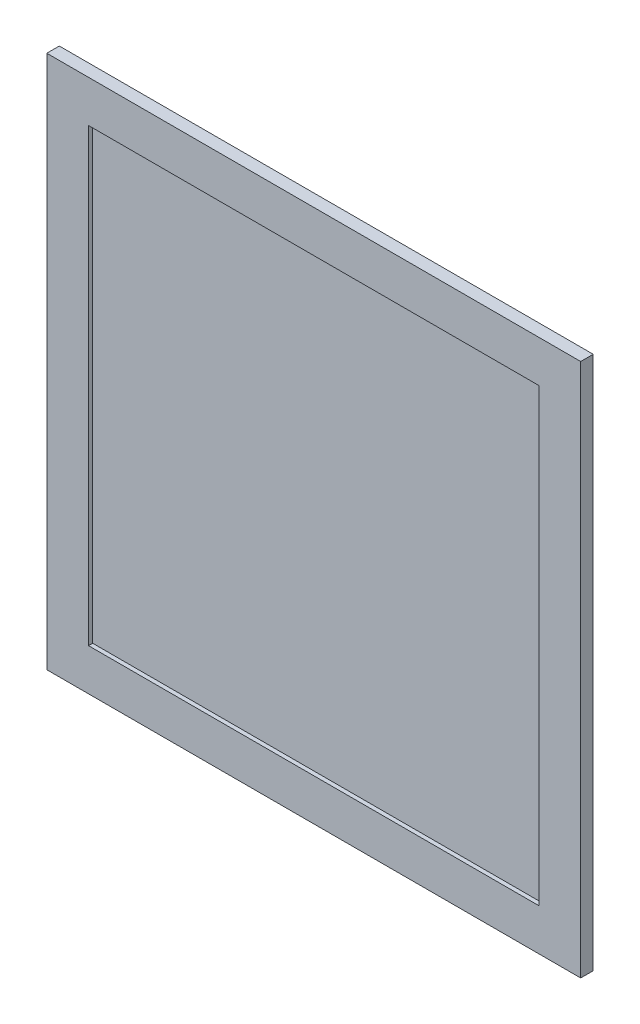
ISO-10303-21;
HEADER;
FILE_DESCRIPTION(('STEP AP214'),'2;1');
FILE_NAME('part.step','',(''),(''),'','','');
FILE_SCHEMA(('AUTOMOTIVE_DESIGN { 1 0 10303 214 1 1 1 1 }'));
ENDSEC;
DATA;
#1=APPLICATION_CONTEXT('core data for automotive mechanical design processes');
#2=APPLICATION_PROTOCOL_DEFINITION('international standard','automotive_design',2000,#1);
#3=PRODUCT_CONTEXT('',#1,'mechanical');
#4=PRODUCT('Part','Part','',(#3));
#5=PRODUCT_RELATED_PRODUCT_CATEGORY('part','',(#4));
#6=PRODUCT_DEFINITION_FORMATION('','',#4);
#7=PRODUCT_DEFINITION_CONTEXT('part definition',#1,'design');
#8=PRODUCT_DEFINITION('design','',#6,#7);
#9=PRODUCT_DEFINITION_SHAPE('','',#8);
#10=(LENGTH_UNIT() NAMED_UNIT(*) SI_UNIT(.MILLI.,.METRE.));
#11=(NAMED_UNIT(*) PLANE_ANGLE_UNIT() SI_UNIT($,.RADIAN.));
#12=(NAMED_UNIT(*) SI_UNIT($,.STERADIAN.) SOLID_ANGLE_UNIT());
#13=UNCERTAINTY_MEASURE_WITH_UNIT(LENGTH_MEASURE(1.E-05),#10,'distance_accuracy_value','');
#14=(GEOMETRIC_REPRESENTATION_CONTEXT(3) GLOBAL_UNCERTAINTY_ASSIGNED_CONTEXT((#13)) GLOBAL_UNIT_ASSIGNED_CONTEXT((#10,
#11,#12)) REPRESENTATION_CONTEXT('',''));
#15=CARTESIAN_POINT('',(0.,0.,0.));
#16=DIRECTION('',(0.,0.,1.));
#17=DIRECTION('',(1.,0.,0.));
#18=AXIS2_PLACEMENT_3D('',#15,#16,#17);
#19=CARTESIAN_POINT('',(0.,0.,0.5));
#20=DIRECTION('',(0.,0.,1.));
#21=DIRECTION('',(1.,0.,0.));
#22=AXIS2_PLACEMENT_3D('',#19,#20,#21);
#23=PLANE('',#22);
#24=DIRECTION('',(1.,0.,0.));
#25=VECTOR('',#24,1.);
#26=CARTESIAN_POINT('',(0.,54.,0.5));
#27=LINE('',#26,#25);
#28=CARTESIAN_POINT('',(-54.,54.,0.5));
#29=VERTEX_POINT('',#28);
#30=CARTESIAN_POINT('',(54.,54.,0.5));
#31=VERTEX_POINT('',#30);
#32=EDGE_CURVE('E50',#29,#31,#27,.T.);
#33=ORIENTED_EDGE('',*,*,#32,.F.);
#34=DIRECTION('',(0.,1.,0.));
#35=VECTOR('',#34,1.);
#36=CARTESIAN_POINT('',(-54.,0.,0.5));
#37=LINE('',#36,#35);
#38=CARTESIAN_POINT('',(-54.,-54.,0.5));
#39=VERTEX_POINT('',#38);
#40=EDGE_CURVE('E54',#39,#29,#37,.T.);
#41=ORIENTED_EDGE('',*,*,#40,.F.);
#42=DIRECTION('',(-1.,0.,0.));
#43=VECTOR('',#42,1.);
#44=CARTESIAN_POINT('',(0.,-54.,0.5));
#45=LINE('',#44,#43);
#46=CARTESIAN_POINT('',(54.,-54.,0.5));
#47=VERTEX_POINT('',#46);
#48=EDGE_CURVE('E197',#47,#39,#45,.T.);
#49=ORIENTED_EDGE('',*,*,#48,.F.);
#50=DIRECTION('',(0.,-1.,0.));
#51=VECTOR('',#50,1.);
#52=CARTESIAN_POINT('',(54.,0.,0.5));
#53=LINE('',#52,#51);
#54=EDGE_CURVE('E184',#31,#47,#53,.T.);
#55=ORIENTED_EDGE('',*,*,#54,.F.);
#56=EDGE_LOOP('',(#33,#41,#49,#55));
#57=FACE_BOUND('',#56,.T.);
#58=ADVANCED_FACE('F35',(#57),#23,.T.);
#59=CARTESIAN_POINT('',(0.,0.,1.5));
#60=DIRECTION('',(0.,0.,1.));
#61=DIRECTION('',(1.,0.,0.));
#62=AXIS2_PLACEMENT_3D('',#59,#60,#61);
#63=PLANE('',#62);
#64=DIRECTION('',(-1.,0.,0.));
#65=VECTOR('',#64,1.);
#66=CARTESIAN_POINT('',(64.,64.,1.5));
#67=LINE('',#66,#65);
#68=CARTESIAN_POINT('',(64.,64.,1.5));
#69=VERTEX_POINT('',#68);
#70=CARTESIAN_POINT('',(-64.,64.,1.5));
#71=VERTEX_POINT('',#70);
#72=EDGE_CURVE('E171',#69,#71,#67,.T.);
#73=ORIENTED_EDGE('',*,*,#72,.T.);
#74=DIRECTION('',(0.,-1.,0.));
#75=VECTOR('',#74,1.);
#76=CARTESIAN_POINT('',(-64.,64.,1.5));
#77=LINE('',#76,#75);
#78=CARTESIAN_POINT('',(-64.,-64.,1.5));
#79=VERTEX_POINT('',#78);
#80=EDGE_CURVE('E174',#71,#79,#77,.T.);
#81=ORIENTED_EDGE('',*,*,#80,.T.);
#82=DIRECTION('',(1.,0.,0.));
#83=VECTOR('',#82,1.);
#84=CARTESIAN_POINT('',(-64.,-64.,1.5));
#85=LINE('',#84,#83);
#86=CARTESIAN_POINT('',(64.,-64.,1.5));
#87=VERTEX_POINT('',#86);
#88=EDGE_CURVE('E178',#79,#87,#85,.T.);
#89=ORIENTED_EDGE('',*,*,#88,.T.);
#90=DIRECTION('',(0.,1.,0.));
#91=VECTOR('',#90,1.);
#92=CARTESIAN_POINT('',(64.,-64.,1.5));
#93=LINE('',#92,#91);
#94=EDGE_CURVE('E181',#87,#69,#93,.T.);
#95=ORIENTED_EDGE('',*,*,#94,.T.);
#96=EDGE_LOOP('',(#73,#81,#89,#95));
#97=FACE_BOUND('',#96,.T.);
#98=DIRECTION('',(0.,-1.,0.));
#99=VECTOR('',#98,1.);
#100=CARTESIAN_POINT('',(-54.,54.,1.5));
#101=LINE('',#100,#99);
#102=CARTESIAN_POINT('',(-54.,54.,1.5));
#103=VERTEX_POINT('',#102);
#104=CARTESIAN_POINT('',(-54.,-54.,1.5));
#105=VERTEX_POINT('',#104);
#106=EDGE_CURVE('E132',#103,#105,#101,.T.);
#107=ORIENTED_EDGE('',*,*,#106,.F.);
#108=DIRECTION('',(-1.,0.,0.));
#109=VECTOR('',#108,1.);
#110=CARTESIAN_POINT('',(54.,54.,1.5));
#111=LINE('',#110,#109);
#112=CARTESIAN_POINT('',(54.,54.,1.5));
#113=VERTEX_POINT('',#112);
#114=EDGE_CURVE('E123',#113,#103,#111,.T.);
#115=ORIENTED_EDGE('',*,*,#114,.F.);
#116=DIRECTION('',(0.,1.,0.));
#117=VECTOR('',#116,1.);
#118=CARTESIAN_POINT('',(54.,-54.,1.5));
#119=LINE('',#118,#117);
#120=CARTESIAN_POINT('',(54.,-54.,1.5));
#121=VERTEX_POINT('',#120);
#122=EDGE_CURVE('E147',#121,#113,#119,.T.);
#123=ORIENTED_EDGE('',*,*,#122,.F.);
#124=DIRECTION('',(1.,0.,0.));
#125=VECTOR('',#124,1.);
#126=CARTESIAN_POINT('',(-54.,-54.,1.5));
#127=LINE('',#126,#125);
#128=EDGE_CURVE('E145',#105,#121,#127,.T.);
#129=ORIENTED_EDGE('',*,*,#128,.F.);
#130=EDGE_LOOP('',(#107,#115,#123,#129));
#131=FACE_BOUND('',#130,.T.);
#132=ADVANCED_FACE('F143',(#97,#131),#63,.T.);
#133=CARTESIAN_POINT('',(54.,54.,1.5));
#134=DIRECTION('',(0.,-1.,0.));
#135=DIRECTION('',(0.,0.,-1.));
#136=AXIS2_PLACEMENT_3D('',#133,#134,#135);
#137=PLANE('',#136);
#138=DIRECTION('',(0.,0.,-1.));
#139=VECTOR('',#138,1.);
#140=CARTESIAN_POINT('',(-54.,54.,1.5));
#141=LINE('',#140,#139);
#142=EDGE_CURVE('E126',#103,#29,#141,.T.);
#143=ORIENTED_EDGE('',*,*,#142,.T.);
#144=ORIENTED_EDGE('',*,*,#32,.T.);
#145=DIRECTION('',(0.,0.,-1.));
#146=VECTOR('',#145,1.);
#147=CARTESIAN_POINT('',(54.,54.,1.5));
#148=LINE('',#147,#146);
#149=EDGE_CURVE('E128',#113,#31,#148,.T.);
#150=ORIENTED_EDGE('',*,*,#149,.F.);
#151=ORIENTED_EDGE('',*,*,#114,.T.);
#152=EDGE_LOOP('',(#143,#144,#150,#151));
#153=FACE_BOUND('',#152,.T.);
#154=ADVANCED_FACE('F125',(#153),#137,.T.);
#155=CARTESIAN_POINT('',(-54.,54.,1.5));
#156=DIRECTION('',(1.,0.,0.));
#157=DIRECTION('',(0.,0.,-1.));
#158=AXIS2_PLACEMENT_3D('',#155,#156,#157);
#159=PLANE('',#158);
#160=DIRECTION('',(0.,0.,-1.));
#161=VECTOR('',#160,1.);
#162=CARTESIAN_POINT('',(-54.,-54.,1.5));
#163=LINE('',#162,#161);
#164=EDGE_CURVE('E169',#105,#39,#163,.T.);
#165=ORIENTED_EDGE('',*,*,#164,.T.);
#166=ORIENTED_EDGE('',*,*,#40,.T.);
#167=ORIENTED_EDGE('',*,*,#142,.F.);
#168=ORIENTED_EDGE('',*,*,#106,.T.);
#169=EDGE_LOOP('',(#165,#166,#167,#168));
#170=FACE_BOUND('',#169,.T.);
#171=ADVANCED_FACE('F137',(#170),#159,.T.);
#172=CARTESIAN_POINT('',(-54.,-54.,1.5));
#173=DIRECTION('',(0.,1.,0.));
#174=DIRECTION('',(-1.,0.,0.));
#175=AXIS2_PLACEMENT_3D('',#172,#173,#174);
#176=PLANE('',#175);
#177=DIRECTION('',(0.,0.,-1.));
#178=VECTOR('',#177,1.);
#179=CARTESIAN_POINT('',(54.,-54.,1.5));
#180=LINE('',#179,#178);
#181=EDGE_CURVE('E165',#121,#47,#180,.T.);
#182=ORIENTED_EDGE('',*,*,#181,.T.);
#183=ORIENTED_EDGE('',*,*,#48,.T.);
#184=ORIENTED_EDGE('',*,*,#164,.F.);
#185=ORIENTED_EDGE('',*,*,#128,.T.);
#186=EDGE_LOOP('',(#182,#183,#184,#185));
#187=FACE_BOUND('',#186,.T.);
#188=ADVANCED_FACE('F243',(#187),#176,.T.);
#189=CARTESIAN_POINT('',(54.,-54.,1.5));
#190=DIRECTION('',(-1.,0.,0.));
#191=DIRECTION('',(0.,0.,1.));
#192=AXIS2_PLACEMENT_3D('',#189,#190,#191);
#193=PLANE('',#192);
#194=ORIENTED_EDGE('',*,*,#149,.T.);
#195=ORIENTED_EDGE('',*,*,#54,.T.);
#196=ORIENTED_EDGE('',*,*,#181,.F.);
#197=ORIENTED_EDGE('',*,*,#122,.T.);
#198=EDGE_LOOP('',(#194,#195,#196,#197));
#199=FACE_BOUND('',#198,.T.);
#200=ADVANCED_FACE('F237',(#199),#193,.T.);
#201=CARTESIAN_POINT('',(64.,-64.,0.5));
#202=DIRECTION('',(-1.,0.,0.));
#203=DIRECTION('',(0.,0.,1.));
#204=AXIS2_PLACEMENT_3D('',#201,#202,#203);
#205=PLANE('',#204);
#206=DIRECTION('',(0.,0.,-1.));
#207=VECTOR('',#206,1.);
#208=CARTESIAN_POINT('',(64.,-64.,0.5));
#209=LINE('',#208,#207);
#210=CARTESIAN_POINT('',(64.,-64.,-1.5));
#211=VERTEX_POINT('',#210);
#212=EDGE_CURVE('E205',#87,#211,#209,.T.);
#213=ORIENTED_EDGE('',*,*,#212,.T.);
#214=DIRECTION('',(0.,1.,0.));
#215=VECTOR('',#214,1.);
#216=CARTESIAN_POINT('',(64.,-64.,-1.5));
#217=LINE('',#216,#215);
#218=CARTESIAN_POINT('',(64.,64.,-1.5));
#219=VERTEX_POINT('',#218);
#220=EDGE_CURVE('E175',#211,#219,#217,.T.);
#221=ORIENTED_EDGE('',*,*,#220,.T.);
#222=DIRECTION('',(0.,0.,-1.));
#223=VECTOR('',#222,1.);
#224=CARTESIAN_POINT('',(64.,64.,0.5));
#225=LINE('',#224,#223);
#226=EDGE_CURVE('E203',#69,#219,#225,.T.);
#227=ORIENTED_EDGE('',*,*,#226,.F.);
#228=ORIENTED_EDGE('',*,*,#94,.F.);
#229=EDGE_LOOP('',(#213,#221,#227,#228));
#230=FACE_BOUND('',#229,.T.);
#231=ADVANCED_FACE('F248',(#230),#205,.F.);
#232=CARTESIAN_POINT('',(64.,-64.,0.5));
#233=DIRECTION('',(0.,1.,0.));
#234=DIRECTION('',(-1.,0.,0.));
#235=AXIS2_PLACEMENT_3D('',#232,#233,#234);
#236=PLANE('',#235);
#237=DIRECTION('',(0.,0.,-1.));
#238=VECTOR('',#237,1.);
#239=CARTESIAN_POINT('',(-64.,-64.,0.5));
#240=LINE('',#239,#238);
#241=CARTESIAN_POINT('',(-64.,-64.,-1.5));
#242=VERTEX_POINT('',#241);
#243=EDGE_CURVE('E207',#79,#242,#240,.T.);
#244=ORIENTED_EDGE('',*,*,#243,.T.);
#245=DIRECTION('',(1.,0.,0.));
#246=VECTOR('',#245,1.);
#247=CARTESIAN_POINT('',(-64.,-64.,-1.5));
#248=LINE('',#247,#246);
#249=EDGE_CURVE('E190',#242,#211,#248,.T.);
#250=ORIENTED_EDGE('',*,*,#249,.T.);
#251=ORIENTED_EDGE('',*,*,#212,.F.);
#252=ORIENTED_EDGE('',*,*,#88,.F.);
#253=EDGE_LOOP('',(#244,#250,#251,#252));
#254=FACE_BOUND('',#253,.T.);
#255=ADVANCED_FACE('F264',(#254),#236,.F.);
#256=CARTESIAN_POINT('',(-64.,-64.,0.5));
#257=DIRECTION('',(1.,0.,0.));
#258=DIRECTION('',(0.,0.,-1.));
#259=AXIS2_PLACEMENT_3D('',#256,#257,#258);
#260=PLANE('',#259);
#261=DIRECTION('',(0.,0.,-1.));
#262=VECTOR('',#261,1.);
#263=CARTESIAN_POINT('',(-64.,64.,0.5));
#264=LINE('',#263,#262);
#265=CARTESIAN_POINT('',(-64.,64.,-1.5));
#266=VERTEX_POINT('',#265);
#267=EDGE_CURVE('E201',#71,#266,#264,.T.);
#268=ORIENTED_EDGE('',*,*,#267,.T.);
#269=DIRECTION('',(0.,-1.,0.));
#270=VECTOR('',#269,1.);
#271=CARTESIAN_POINT('',(-64.,64.,-1.5));
#272=LINE('',#271,#270);
#273=EDGE_CURVE('E187',#266,#242,#272,.T.);
#274=ORIENTED_EDGE('',*,*,#273,.T.);
#275=ORIENTED_EDGE('',*,*,#243,.F.);
#276=ORIENTED_EDGE('',*,*,#80,.F.);
#277=EDGE_LOOP('',(#268,#274,#275,#276));
#278=FACE_BOUND('',#277,.T.);
#279=ADVANCED_FACE('F37',(#278),#260,.F.);
#280=CARTESIAN_POINT('',(64.,64.,0.5));
#281=DIRECTION('',(0.,-1.,0.));
#282=DIRECTION('',(0.,0.,-1.));
#283=AXIS2_PLACEMENT_3D('',#280,#281,#282);
#284=PLANE('',#283);
#285=ORIENTED_EDGE('',*,*,#226,.T.);
#286=DIRECTION('',(-1.,0.,0.));
#287=VECTOR('',#286,1.);
#288=CARTESIAN_POINT('',(64.,64.,-1.5));
#289=LINE('',#288,#287);
#290=EDGE_CURVE('E139',#219,#266,#289,.T.);
#291=ORIENTED_EDGE('',*,*,#290,.T.);
#292=ORIENTED_EDGE('',*,*,#267,.F.);
#293=ORIENTED_EDGE('',*,*,#72,.F.);
#294=EDGE_LOOP('',(#285,#291,#292,#293));
#295=FACE_BOUND('',#294,.T.);
#296=ADVANCED_FACE('F244',(#295),#284,.F.);
#297=CARTESIAN_POINT('',(0.,0.,-1.5));
#298=DIRECTION('',(0.,0.,1.));
#299=DIRECTION('',(1.,0.,0.));
#300=AXIS2_PLACEMENT_3D('',#297,#298,#299);
#301=PLANE('',#300);
#302=ORIENTED_EDGE('',*,*,#290,.F.);
#303=ORIENTED_EDGE('',*,*,#220,.F.);
#304=ORIENTED_EDGE('',*,*,#249,.F.);
#305=ORIENTED_EDGE('',*,*,#273,.F.);
#306=EDGE_LOOP('',(#302,#303,#304,#305));
#307=FACE_BOUND('',#306,.T.);
#308=DIRECTION('',(-1.,0.,0.));
#309=VECTOR('',#308,1.);
#310=CARTESIAN_POINT('',(54.,54.,-1.5));
#311=LINE('',#310,#309);
#312=CARTESIAN_POINT('',(54.,54.,-1.5));
#313=VERTEX_POINT('',#312);
#314=CARTESIAN_POINT('',(-54.,54.,-1.5));
#315=VERTEX_POINT('',#314);
#316=EDGE_CURVE('E152',#313,#315,#311,.T.);
#317=ORIENTED_EDGE('',*,*,#316,.T.);
#318=DIRECTION('',(0.,-1.,0.));
#319=VECTOR('',#318,1.);
#320=CARTESIAN_POINT('',(-54.,54.,-1.5));
#321=LINE('',#320,#319);
#322=CARTESIAN_POINT('',(-54.,-54.,-1.5));
#323=VERTEX_POINT('',#322);
#324=EDGE_CURVE('E155',#315,#323,#321,.T.);
#325=ORIENTED_EDGE('',*,*,#324,.T.);
#326=DIRECTION('',(1.,0.,0.));
#327=VECTOR('',#326,1.);
#328=CARTESIAN_POINT('',(-54.,-54.,-1.5));
#329=LINE('',#328,#327);
#330=CARTESIAN_POINT('',(54.,-54.,-1.5));
#331=VERTEX_POINT('',#330);
#332=EDGE_CURVE('E158',#323,#331,#329,.T.);
#333=ORIENTED_EDGE('',*,*,#332,.T.);
#334=DIRECTION('',(0.,1.,0.));
#335=VECTOR('',#334,1.);
#336=CARTESIAN_POINT('',(54.,-54.,-1.5));
#337=LINE('',#336,#335);
#338=EDGE_CURVE('E133',#331,#313,#337,.T.);
#339=ORIENTED_EDGE('',*,*,#338,.T.);
#340=EDGE_LOOP('',(#317,#325,#333,#339));
#341=FACE_BOUND('',#340,.T.);
#342=ADVANCED_FACE('F228',(#307,#341),#301,.F.);
#343=DIRECTION('',(0.,-1.,0.));
#344=VECTOR('',#343,1.);
#345=CARTESIAN_POINT('',(54.,0.,-0.5));
#346=LINE('',#345,#344);
#347=CARTESIAN_POINT('',(54.,54.,-0.5));
#348=VERTEX_POINT('',#347);
#349=CARTESIAN_POINT('',(54.,-54.,-0.5));
#350=VERTEX_POINT('',#349);
#351=EDGE_CURVE('E209',#348,#350,#346,.T.);
#352=ORIENTED_EDGE('',*,*,#351,.F.);
#353=EDGE_CURVE('E151',#348,#313,#148,.T.);
#354=ORIENTED_EDGE('',*,*,#353,.T.);
#355=ORIENTED_EDGE('',*,*,#338,.F.);
#356=EDGE_CURVE('E164',#350,#331,#180,.T.);
#357=ORIENTED_EDGE('',*,*,#356,.F.);
#358=EDGE_LOOP('',(#352,#354,#355,#357));
#359=FACE_BOUND('',#358,.T.);
#360=ADVANCED_FACE('F234',(#359),#193,.T.);
#361=DIRECTION('',(-1.,0.,0.));
#362=VECTOR('',#361,1.);
#363=CARTESIAN_POINT('',(0.,-54.,-0.5));
#364=LINE('',#363,#362);
#365=CARTESIAN_POINT('',(-54.,-54.,-0.5));
#366=VERTEX_POINT('',#365);
#367=EDGE_CURVE('E212',#350,#366,#364,.T.);
#368=ORIENTED_EDGE('',*,*,#367,.F.);
#369=ORIENTED_EDGE('',*,*,#356,.T.);
#370=ORIENTED_EDGE('',*,*,#332,.F.);
#371=EDGE_CURVE('E168',#366,#323,#163,.T.);
#372=ORIENTED_EDGE('',*,*,#371,.F.);
#373=EDGE_LOOP('',(#368,#369,#370,#372));
#374=FACE_BOUND('',#373,.T.);
#375=ADVANCED_FACE('F225',(#374),#176,.T.);
#376=DIRECTION('',(0.,1.,0.));
#377=VECTOR('',#376,1.);
#378=CARTESIAN_POINT('',(-54.,0.,-0.5));
#379=LINE('',#378,#377);
#380=CARTESIAN_POINT('',(-54.,54.,-0.5));
#381=VERTEX_POINT('',#380);
#382=EDGE_CURVE('E43',#366,#381,#379,.T.);
#383=ORIENTED_EDGE('',*,*,#382,.F.);
#384=ORIENTED_EDGE('',*,*,#371,.T.);
#385=ORIENTED_EDGE('',*,*,#324,.F.);
#386=EDGE_CURVE('E140',#381,#315,#141,.T.);
#387=ORIENTED_EDGE('',*,*,#386,.F.);
#388=EDGE_LOOP('',(#383,#384,#385,#387));
#389=FACE_BOUND('',#388,.T.);
#390=ADVANCED_FACE('F221',(#389),#159,.T.);
#391=DIRECTION('',(1.,0.,0.));
#392=VECTOR('',#391,1.);
#393=CARTESIAN_POINT('',(0.,54.,-0.5));
#394=LINE('',#393,#392);
#395=EDGE_CURVE('E11',#381,#348,#394,.T.);
#396=ORIENTED_EDGE('',*,*,#395,.F.);
#397=ORIENTED_EDGE('',*,*,#386,.T.);
#398=ORIENTED_EDGE('',*,*,#316,.F.);
#399=ORIENTED_EDGE('',*,*,#353,.F.);
#400=EDGE_LOOP('',(#396,#397,#398,#399));
#401=FACE_BOUND('',#400,.T.);
#402=ADVANCED_FACE('F232',(#401),#137,.T.);
#403=CARTESIAN_POINT('',(0.,0.,-0.5));
#404=DIRECTION('',(0.,0.,1.));
#405=DIRECTION('',(1.,0.,0.));
#406=AXIS2_PLACEMENT_3D('',#403,#404,#405);
#407=PLANE('',#406);
#408=ORIENTED_EDGE('',*,*,#382,.T.);
#409=ORIENTED_EDGE('',*,*,#395,.T.);
#410=ORIENTED_EDGE('',*,*,#351,.T.);
#411=ORIENTED_EDGE('',*,*,#367,.T.);
#412=EDGE_LOOP('',(#408,#409,#410,#411));
#413=FACE_BOUND('',#412,.T.);
#414=ADVANCED_FACE('F216',(#413),#407,.F.);
#415=CLOSED_SHELL('',(#58,#132,#154,#171,#188,#200,#231,#255,#279,#296,#342,#360,#375,#390,#402,#414));
#416=MANIFOLD_SOLID_BREP('B2',#415);
#417=ADVANCED_BREP_SHAPE_REPRESENTATION('',(#18,#416),#14);
#418=SHAPE_DEFINITION_REPRESENTATION(#9,#417);
ENDSEC;
END-ISO-10303-21;
